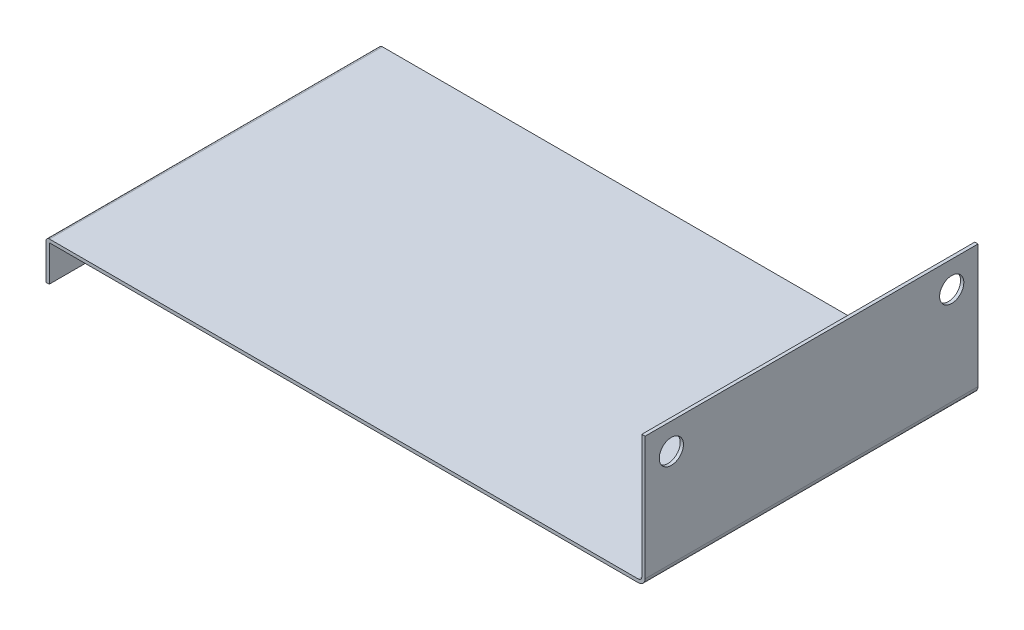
ISO-10303-21;
HEADER;
FILE_DESCRIPTION(('STEP AP214'),'2;1');
FILE_NAME('part.step','',(''),(''),'','','');
FILE_SCHEMA(('AUTOMOTIVE_DESIGN { 1 0 10303 214 1 1 1 1 }'));
ENDSEC;
DATA;
#1=APPLICATION_CONTEXT('core data for automotive mechanical design processes');
#2=APPLICATION_PROTOCOL_DEFINITION('international standard','automotive_design',2000,#1);
#3=PRODUCT_CONTEXT('',#1,'mechanical');
#4=PRODUCT('Part','Part','',(#3));
#5=PRODUCT_RELATED_PRODUCT_CATEGORY('part','',(#4));
#6=PRODUCT_DEFINITION_FORMATION('','',#4);
#7=PRODUCT_DEFINITION_CONTEXT('part definition',#1,'design');
#8=PRODUCT_DEFINITION('design','',#6,#7);
#9=PRODUCT_DEFINITION_SHAPE('','',#8);
#10=(LENGTH_UNIT() NAMED_UNIT(*) SI_UNIT(.MILLI.,.METRE.));
#11=(NAMED_UNIT(*) PLANE_ANGLE_UNIT() SI_UNIT($,.RADIAN.));
#12=(NAMED_UNIT(*) SI_UNIT($,.STERADIAN.) SOLID_ANGLE_UNIT());
#13=UNCERTAINTY_MEASURE_WITH_UNIT(LENGTH_MEASURE(1.E-05),#10,'distance_accuracy_value','');
#14=(GEOMETRIC_REPRESENTATION_CONTEXT(3) GLOBAL_UNCERTAINTY_ASSIGNED_CONTEXT((#13)) GLOBAL_UNIT_ASSIGNED_CONTEXT((#10,
#11,#12)) REPRESENTATION_CONTEXT('',''));
#15=CARTESIAN_POINT('',(0.,0.,0.));
#16=DIRECTION('',(0.,0.,1.));
#17=DIRECTION('',(1.,0.,0.));
#18=AXIS2_PLACEMENT_3D('',#15,#16,#17);
#19=CARTESIAN_POINT('',(218.2622,2.54000000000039,120.65));
#20=DIRECTION('',(-1.,0.,0.));
#21=DIRECTION('',(0.,0.,1.00000000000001));
#22=AXIS2_PLACEMENT_3D('',#19,#20,#21);
#23=PLANE('',#22);
#24=CARTESIAN_POINT('',(218.2622,73.0250000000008,-101.6));
#25=DIRECTION('',(1.,0.,0.));
#26=DIRECTION('',(0.,1.00000000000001,0.));
#27=AXIS2_PLACEMENT_3D('',#24,#25,#26);
#28=CIRCLE('',#27,8.76299999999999);
#29=CARTESIAN_POINT('',(218.2622,81.7880000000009,-101.6));
#30=VERTEX_POINT('',#29);
#31=EDGE_CURVE('E217',#30,#30,#28,.T.);
#32=ORIENTED_EDGE('',*,*,#31,.F.);
#33=EDGE_LOOP('',(#32));
#34=FACE_BOUND('',#33,.T.);
#35=CARTESIAN_POINT('',(218.2622,73.0250000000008,101.6));
#36=DIRECTION('',(1.,0.,0.));
#37=DIRECTION('',(0.,1.00000000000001,0.));
#38=AXIS2_PLACEMENT_3D('',#35,#36,#37);
#39=CIRCLE('',#38,8.76299999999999);
#40=CARTESIAN_POINT('',(218.2622,81.7880000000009,101.6));
#41=VERTEX_POINT('',#40);
#42=EDGE_CURVE('E214',#41,#41,#39,.T.);
#43=ORIENTED_EDGE('',*,*,#42,.F.);
#44=EDGE_LOOP('',(#43));
#45=FACE_BOUND('',#44,.T.);
#46=DIRECTION('',(0.,1.00000000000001,0.));
#47=VECTOR('',#46,1.);
#48=CARTESIAN_POINT('',(218.2622,2.54000000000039,-120.65));
#49=LINE('',#48,#47);
#50=CARTESIAN_POINT('',(218.2622,2.54000000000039,-120.65));
#51=VERTEX_POINT('',#50);
#52=CARTESIAN_POINT('',(218.2622,92.0750000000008,-120.65));
#53=VERTEX_POINT('',#52);
#54=EDGE_CURVE('E126',#51,#53,#49,.T.);
#55=ORIENTED_EDGE('',*,*,#54,.T.);
#56=DIRECTION('',(0.,0.,-1.00000000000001));
#57=VECTOR('',#56,1.);
#58=CARTESIAN_POINT('',(218.2622,92.0750000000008,120.65));
#59=LINE('',#58,#57);
#60=CARTESIAN_POINT('',(218.2622,92.0750000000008,120.65));
#61=VERTEX_POINT('',#60);
#62=EDGE_CURVE('E11',#61,#53,#59,.T.);
#63=ORIENTED_EDGE('',*,*,#62,.F.);
#64=DIRECTION('',(0.,1.00000000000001,0.));
#65=VECTOR('',#64,1.);
#66=CARTESIAN_POINT('',(218.2622,2.54000000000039,120.65));
#67=LINE('',#66,#65);
#68=CARTESIAN_POINT('',(218.2622,2.54000000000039,120.65));
#69=VERTEX_POINT('',#68);
#70=EDGE_CURVE('E162',#69,#61,#67,.T.);
#71=ORIENTED_EDGE('',*,*,#70,.F.);
#72=DIRECTION('',(0.,0.,-1.00000000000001));
#73=VECTOR('',#72,1.);
#74=CARTESIAN_POINT('',(218.2622,2.54000000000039,120.65));
#75=LINE('',#74,#73);
#76=EDGE_CURVE('E127',#69,#51,#75,.T.);
#77=ORIENTED_EDGE('',*,*,#76,.T.);
#78=EDGE_LOOP('',(#55,#63,#71,#77));
#79=FACE_BOUND('',#78,.T.);
#80=ADVANCED_FACE('F26',(#34,#45,#79),#23,.F.);
#81=CARTESIAN_POINT('',(215.9,92.0750000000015,120.65));
#82=DIRECTION('',(0.,1.00000000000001,0.));
#83=DIRECTION('',(0.,0.,1.00000000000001));
#84=AXIS2_PLACEMENT_3D('',#81,#82,#83);
#85=PLANE('',#84);
#86=DIRECTION('',(1.,0.,0.));
#87=VECTOR('',#86,1.);
#88=CARTESIAN_POINT('',(215.9,92.0750000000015,-120.65));
#89=LINE('',#88,#87);
#90=CARTESIAN_POINT('',(215.9,92.0750000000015,-120.65));
#91=VERTEX_POINT('',#90);
#92=EDGE_CURVE('E118',#91,#53,#89,.T.);
#93=ORIENTED_EDGE('',*,*,#92,.F.);
#94=DIRECTION('',(0.,0.,-1.00000000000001));
#95=VECTOR('',#94,1.);
#96=CARTESIAN_POINT('',(215.9,92.0750000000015,120.65));
#97=LINE('',#96,#95);
#98=CARTESIAN_POINT('',(215.9,92.0750000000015,120.65));
#99=VERTEX_POINT('',#98);
#100=EDGE_CURVE('E34',#99,#91,#97,.T.);
#101=ORIENTED_EDGE('',*,*,#100,.F.);
#102=DIRECTION('',(1.,0.,0.));
#103=VECTOR('',#102,1.);
#104=CARTESIAN_POINT('',(215.9,92.0750000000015,120.65));
#105=LINE('',#104,#103);
#106=EDGE_CURVE('E121',#99,#61,#105,.T.);
#107=ORIENTED_EDGE('',*,*,#106,.T.);
#108=ORIENTED_EDGE('',*,*,#62,.T.);
#109=EDGE_LOOP('',(#93,#101,#107,#108));
#110=FACE_BOUND('',#109,.T.);
#111=ADVANCED_FACE('F116',(#110),#85,.T.);
#112=CARTESIAN_POINT('',(215.9,2.54000000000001,120.65));
#113=DIRECTION('',(-1.,0.,0.));
#114=DIRECTION('',(0.,0.,1.00000000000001));
#115=AXIS2_PLACEMENT_3D('',#112,#113,#114);
#116=PLANE('',#115);
#117=CARTESIAN_POINT('',(215.9,73.0250000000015,-101.6));
#118=DIRECTION('',(-1.,0.,0.));
#119=DIRECTION('',(0.,0.,1.00000000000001));
#120=AXIS2_PLACEMENT_3D('',#117,#118,#119);
#121=CIRCLE('',#120,8.76299999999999);
#122=CARTESIAN_POINT('',(215.9,81.7880000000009,-101.6));
#123=VERTEX_POINT('',#122);
#124=EDGE_CURVE('E215',#123,#123,#121,.T.);
#125=ORIENTED_EDGE('',*,*,#124,.F.);
#126=EDGE_LOOP('',(#125));
#127=FACE_BOUND('',#126,.T.);
#128=CARTESIAN_POINT('',(215.9,73.0250000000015,101.6));
#129=DIRECTION('',(-1.,0.,0.));
#130=DIRECTION('',(0.,0.,1.00000000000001));
#131=AXIS2_PLACEMENT_3D('',#128,#129,#130);
#132=CIRCLE('',#131,8.76299999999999);
#133=CARTESIAN_POINT('',(215.9,81.7880000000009,101.6));
#134=VERTEX_POINT('',#133);
#135=EDGE_CURVE('E130',#134,#134,#132,.T.);
#136=ORIENTED_EDGE('',*,*,#135,.F.);
#137=EDGE_LOOP('',(#136));
#138=FACE_BOUND('',#137,.T.);
#139=DIRECTION('',(0.,1.00000000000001,0.));
#140=VECTOR('',#139,1.);
#141=CARTESIAN_POINT('',(215.9,2.54000000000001,-120.65));
#142=LINE('',#141,#140);
#143=CARTESIAN_POINT('',(215.9,2.54000000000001,-120.65));
#144=VERTEX_POINT('',#143);
#145=EDGE_CURVE('E135',#144,#91,#142,.T.);
#146=ORIENTED_EDGE('',*,*,#145,.F.);
#147=DIRECTION('',(0.,0.,-1.00000000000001));
#148=VECTOR('',#147,1.);
#149=CARTESIAN_POINT('',(215.9,2.54000000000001,120.65));
#150=LINE('',#149,#148);
#151=CARTESIAN_POINT('',(215.9,2.54000000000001,120.65));
#152=VERTEX_POINT('',#151);
#153=EDGE_CURVE('E209',#152,#144,#150,.T.);
#154=ORIENTED_EDGE('',*,*,#153,.F.);
#155=DIRECTION('',(0.,1.00000000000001,0.));
#156=VECTOR('',#155,1.);
#157=CARTESIAN_POINT('',(215.9,2.54000000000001,120.65));
#158=LINE('',#157,#156);
#159=EDGE_CURVE('E165',#152,#99,#158,.T.);
#160=ORIENTED_EDGE('',*,*,#159,.T.);
#161=ORIENTED_EDGE('',*,*,#100,.T.);
#162=EDGE_LOOP('',(#146,#154,#160,#161));
#163=FACE_BOUND('',#162,.T.);
#164=ADVANCED_FACE('F242',(#127,#138,#163),#116,.T.);
#165=CARTESIAN_POINT('',(213.36,2.54000000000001,120.65));
#166=DIRECTION('',(0.,0.,-1.00000000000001));
#167=DIRECTION('',(-1.,0.,0.));
#168=AXIS2_PLACEMENT_3D('',#165,#166,#167);
#169=CYLINDRICAL_SURFACE('',#168,2.54000000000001);
#170=CARTESIAN_POINT('',(213.36,2.54000000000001,-120.65));
#171=DIRECTION('',(0.,0.,1.00000000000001));
#172=DIRECTION('',(1.,0.,0.));
#173=AXIS2_PLACEMENT_3D('',#170,#171,#172);
#174=CIRCLE('',#173,2.54000000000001);
#175=CARTESIAN_POINT('',(213.36,0.,-120.65));
#176=VERTEX_POINT('',#175);
#177=EDGE_CURVE('E137',#176,#144,#174,.T.);
#178=ORIENTED_EDGE('',*,*,#177,.F.);
#179=DIRECTION('',(0.,0.,-1.00000000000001));
#180=VECTOR('',#179,1.);
#181=CARTESIAN_POINT('',(213.36,0.,120.65));
#182=LINE('',#181,#180);
#183=CARTESIAN_POINT('',(213.36,0.,120.65));
#184=VERTEX_POINT('',#183);
#185=EDGE_CURVE('E207',#184,#176,#182,.T.);
#186=ORIENTED_EDGE('',*,*,#185,.F.);
#187=CARTESIAN_POINT('',(213.36,2.54000000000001,120.65));
#188=DIRECTION('',(0.,0.,1.00000000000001));
#189=DIRECTION('',(1.,0.,0.));
#190=AXIS2_PLACEMENT_3D('',#187,#188,#189);
#191=CIRCLE('',#190,2.54000000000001);
#192=EDGE_CURVE('E168',#184,#152,#191,.T.);
#193=ORIENTED_EDGE('',*,*,#192,.T.);
#194=ORIENTED_EDGE('',*,*,#153,.T.);
#195=EDGE_LOOP('',(#178,#186,#193,#194));
#196=FACE_BOUND('',#195,.T.);
#197=ADVANCED_FACE('F297',(#196),#169,.F.);
#198=CARTESIAN_POINT('',(-213.36,3.60822483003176E-13,120.65));
#199=DIRECTION('',(0.,1.00000000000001,0.));
#200=DIRECTION('',(0.,0.,1.00000000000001));
#201=AXIS2_PLACEMENT_3D('',#198,#199,#200);
#202=PLANE('',#201);
#203=DIRECTION('',(1.,0.,0.));
#204=VECTOR('',#203,1.);
#205=CARTESIAN_POINT('',(-213.36,3.60822483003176E-13,-120.65));
#206=LINE('',#205,#204);
#207=CARTESIAN_POINT('',(-213.36,3.53883589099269E-13,-120.65));
#208=VERTEX_POINT('',#207);
#209=EDGE_CURVE('E142',#208,#176,#206,.T.);
#210=ORIENTED_EDGE('',*,*,#209,.F.);
#211=DIRECTION('',(0.,0.,-1.00000000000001));
#212=VECTOR('',#211,1.);
#213=CARTESIAN_POINT('',(-213.36,3.53883589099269E-13,120.65));
#214=LINE('',#213,#212);
#215=CARTESIAN_POINT('',(-213.36,3.53883589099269E-13,120.65));
#216=VERTEX_POINT('',#215);
#217=EDGE_CURVE('E205',#216,#208,#214,.T.);
#218=ORIENTED_EDGE('',*,*,#217,.F.);
#219=DIRECTION('',(1.,0.,0.));
#220=VECTOR('',#219,1.);
#221=CARTESIAN_POINT('',(-213.36,3.60822483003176E-13,120.65));
#222=LINE('',#221,#220);
#223=EDGE_CURVE('E171',#216,#184,#222,.T.);
#224=ORIENTED_EDGE('',*,*,#223,.T.);
#225=ORIENTED_EDGE('',*,*,#185,.T.);
#226=EDGE_LOOP('',(#210,#218,#224,#225));
#227=FACE_BOUND('',#226,.T.);
#228=ADVANCED_FACE('F293',(#227),#202,.T.);
#229=CARTESIAN_POINT('',(-213.36,-2.53999999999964,120.65));
#230=DIRECTION('',(0.,0.,-1.00000000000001));
#231=DIRECTION('',(-1.,0.,0.));
#232=AXIS2_PLACEMENT_3D('',#229,#230,#231);
#233=CYLINDRICAL_SURFACE('',#232,2.53999999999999);
#234=CARTESIAN_POINT('',(-213.36,-2.53999999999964,-120.65));
#235=DIRECTION('',(0.,0.,-1.00000000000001));
#236=DIRECTION('',(-1.,0.,0.));
#237=AXIS2_PLACEMENT_3D('',#234,#235,#236);
#238=CIRCLE('',#237,2.53999999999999);
#239=CARTESIAN_POINT('',(-215.9,-2.54000000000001,-120.65));
#240=VERTEX_POINT('',#239);
#241=EDGE_CURVE('E145',#240,#208,#238,.T.);
#242=ORIENTED_EDGE('',*,*,#241,.F.);
#243=DIRECTION('',(0.,0.,-1.00000000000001));
#244=VECTOR('',#243,1.);
#245=CARTESIAN_POINT('',(-215.9,-2.54000000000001,120.65));
#246=LINE('',#245,#244);
#247=CARTESIAN_POINT('',(-215.9,-2.54000000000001,120.65));
#248=VERTEX_POINT('',#247);
#249=EDGE_CURVE('E203',#248,#240,#246,.T.);
#250=ORIENTED_EDGE('',*,*,#249,.F.);
#251=CARTESIAN_POINT('',(-213.36,-2.53999999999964,120.65));
#252=DIRECTION('',(0.,0.,-1.00000000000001));
#253=DIRECTION('',(-1.,0.,0.));
#254=AXIS2_PLACEMENT_3D('',#251,#252,#253);
#255=CIRCLE('',#254,2.53999999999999);
#256=EDGE_CURVE('E174',#248,#216,#255,.T.);
#257=ORIENTED_EDGE('',*,*,#256,.T.);
#258=ORIENTED_EDGE('',*,*,#217,.T.);
#259=EDGE_LOOP('',(#242,#250,#257,#258));
#260=FACE_BOUND('',#259,.T.);
#261=ADVANCED_FACE('F289',(#260),#233,.T.);
#262=CARTESIAN_POINT('',(-215.9,-28.448,120.65));
#263=DIRECTION('',(-1.,0.,0.));
#264=DIRECTION('',(0.,0.,1.00000000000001));
#265=AXIS2_PLACEMENT_3D('',#262,#263,#264);
#266=PLANE('',#265);
#267=CARTESIAN_POINT('',(-215.9,-15.7479999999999,-88.9));
#268=DIRECTION('',(1.,0.,0.));
#269=DIRECTION('',(0.,1.00000000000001,0.));
#270=AXIS2_PLACEMENT_3D('',#267,#268,#269);
#271=CIRCLE('',#270,5.20700000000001);
#272=CARTESIAN_POINT('',(-215.9,-10.5409999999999,-88.9));
#273=VERTEX_POINT('',#272);
#274=EDGE_CURVE('E230',#273,#273,#271,.T.);
#275=ORIENTED_EDGE('',*,*,#274,.T.);
#276=EDGE_LOOP('',(#275));
#277=FACE_BOUND('',#276,.T.);
#278=CARTESIAN_POINT('',(-215.9,-15.7479999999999,88.9));
#279=DIRECTION('',(1.,0.,0.));
#280=DIRECTION('',(0.,1.00000000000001,0.));
#281=AXIS2_PLACEMENT_3D('',#278,#279,#280);
#282=CIRCLE('',#281,5.20700000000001);
#283=CARTESIAN_POINT('',(-215.9,-10.5409999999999,88.9));
#284=VERTEX_POINT('',#283);
#285=EDGE_CURVE('E220',#284,#284,#282,.T.);
#286=ORIENTED_EDGE('',*,*,#285,.T.);
#287=EDGE_LOOP('',(#286));
#288=FACE_BOUND('',#287,.T.);
#289=DIRECTION('',(0.,1.00000000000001,0.));
#290=VECTOR('',#289,1.);
#291=CARTESIAN_POINT('',(-215.9,-28.448,-120.65));
#292=LINE('',#291,#290);
#293=CARTESIAN_POINT('',(-215.9,-28.448,-120.65));
#294=VERTEX_POINT('',#293);
#295=EDGE_CURVE('E148',#294,#240,#292,.T.);
#296=ORIENTED_EDGE('',*,*,#295,.F.);
#297=DIRECTION('',(0.,0.,-1.00000000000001));
#298=VECTOR('',#297,1.);
#299=CARTESIAN_POINT('',(-215.9,-28.448,120.65));
#300=LINE('',#299,#298);
#301=CARTESIAN_POINT('',(-215.9,-28.448,120.65));
#302=VERTEX_POINT('',#301);
#303=EDGE_CURVE('E201',#302,#294,#300,.T.);
#304=ORIENTED_EDGE('',*,*,#303,.F.);
#305=DIRECTION('',(0.,1.00000000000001,0.));
#306=VECTOR('',#305,1.);
#307=CARTESIAN_POINT('',(-215.9,-28.448,120.65));
#308=LINE('',#307,#306);
#309=EDGE_CURVE('E177',#302,#248,#308,.T.);
#310=ORIENTED_EDGE('',*,*,#309,.T.);
#311=ORIENTED_EDGE('',*,*,#249,.T.);
#312=EDGE_LOOP('',(#296,#304,#310,#311));
#313=FACE_BOUND('',#312,.T.);
#314=ADVANCED_FACE('F285',(#277,#288,#313),#266,.T.);
#315=CARTESIAN_POINT('',(-213.5378,-28.448,120.65));
#316=DIRECTION('',(0.,-1.00000000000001,0.));
#317=DIRECTION('',(0.,0.,-1.00000000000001));
#318=AXIS2_PLACEMENT_3D('',#315,#316,#317);
#319=PLANE('',#318);
#320=DIRECTION('',(-1.,0.,0.));
#321=VECTOR('',#320,1.);
#322=CARTESIAN_POINT('',(-213.5378,-28.448,-120.65));
#323=LINE('',#322,#321);
#324=CARTESIAN_POINT('',(-213.5378,-28.448,-120.65));
#325=VERTEX_POINT('',#324);
#326=EDGE_CURVE('E151',#325,#294,#323,.T.);
#327=ORIENTED_EDGE('',*,*,#326,.F.);
#328=DIRECTION('',(0.,0.,-1.00000000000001));
#329=VECTOR('',#328,1.);
#330=CARTESIAN_POINT('',(-213.5378,-28.448,120.65));
#331=LINE('',#330,#329);
#332=CARTESIAN_POINT('',(-213.5378,-28.448,120.65));
#333=VERTEX_POINT('',#332);
#334=EDGE_CURVE('E199',#333,#325,#331,.T.);
#335=ORIENTED_EDGE('',*,*,#334,.F.);
#336=DIRECTION('',(-1.,0.,0.));
#337=VECTOR('',#336,1.);
#338=CARTESIAN_POINT('',(-213.5378,-28.448,120.65));
#339=LINE('',#338,#337);
#340=EDGE_CURVE('E180',#333,#302,#339,.T.);
#341=ORIENTED_EDGE('',*,*,#340,.T.);
#342=ORIENTED_EDGE('',*,*,#303,.T.);
#343=EDGE_LOOP('',(#327,#335,#341,#342));
#344=FACE_BOUND('',#343,.T.);
#345=ADVANCED_FACE('F281',(#344),#319,.T.);
#346=CARTESIAN_POINT('',(-213.5378,-28.448,120.65));
#347=DIRECTION('',(-1.,0.,0.));
#348=DIRECTION('',(0.,0.,1.00000000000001));
#349=AXIS2_PLACEMENT_3D('',#346,#347,#348);
#350=PLANE('',#349);
#351=CARTESIAN_POINT('',(-213.5378,-15.7479999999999,-88.9));
#352=DIRECTION('',(-1.,0.,0.));
#353=DIRECTION('',(0.,0.,1.00000000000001));
#354=AXIS2_PLACEMENT_3D('',#351,#352,#353);
#355=CIRCLE('',#354,5.20700000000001);
#356=CARTESIAN_POINT('',(-213.5378,-10.5409999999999,-88.9));
#357=VERTEX_POINT('',#356);
#358=EDGE_CURVE('E29',#357,#357,#355,.T.);
#359=ORIENTED_EDGE('',*,*,#358,.T.);
#360=EDGE_LOOP('',(#359));
#361=FACE_BOUND('',#360,.T.);
#362=CARTESIAN_POINT('',(-213.5378,-15.7479999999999,88.9));
#363=DIRECTION('',(-1.,0.,0.));
#364=DIRECTION('',(0.,0.,1.00000000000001));
#365=AXIS2_PLACEMENT_3D('',#362,#363,#364);
#366=CIRCLE('',#365,5.20700000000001);
#367=CARTESIAN_POINT('',(-213.5378,-10.5409999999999,88.9));
#368=VERTEX_POINT('',#367);
#369=EDGE_CURVE('E218',#368,#368,#366,.T.);
#370=ORIENTED_EDGE('',*,*,#369,.T.);
#371=EDGE_LOOP('',(#370));
#372=FACE_BOUND('',#371,.T.);
#373=DIRECTION('',(0.,1.00000000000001,0.));
#374=VECTOR('',#373,1.);
#375=CARTESIAN_POINT('',(-213.5378,-28.448,-120.65));
#376=LINE('',#375,#374);
#377=CARTESIAN_POINT('',(-213.5378,-2.54000000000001,-120.65));
#378=VERTEX_POINT('',#377);
#379=EDGE_CURVE('E154',#325,#378,#376,.T.);
#380=ORIENTED_EDGE('',*,*,#379,.T.);
#381=DIRECTION('',(0.,0.,-1.00000000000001));
#382=VECTOR('',#381,1.);
#383=CARTESIAN_POINT('',(-213.5378,-2.54000000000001,120.65));
#384=LINE('',#383,#382);
#385=CARTESIAN_POINT('',(-213.5378,-2.54000000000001,120.65));
#386=VERTEX_POINT('',#385);
#387=EDGE_CURVE('E196',#386,#378,#384,.T.);
#388=ORIENTED_EDGE('',*,*,#387,.F.);
#389=DIRECTION('',(0.,1.00000000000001,0.));
#390=VECTOR('',#389,1.);
#391=CARTESIAN_POINT('',(-213.5378,-28.448,120.65));
#392=LINE('',#391,#390);
#393=EDGE_CURVE('E183',#333,#386,#392,.T.);
#394=ORIENTED_EDGE('',*,*,#393,.F.);
#395=ORIENTED_EDGE('',*,*,#334,.T.);
#396=EDGE_LOOP('',(#380,#388,#394,#395));
#397=FACE_BOUND('',#396,.T.);
#398=ADVANCED_FACE('F277',(#361,#372,#397),#350,.F.);
#399=CARTESIAN_POINT('',(-213.36,-2.53999999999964,120.65));
#400=DIRECTION('',(0.,0.,-1.00000000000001));
#401=DIRECTION('',(-1.,0.,0.));
#402=AXIS2_PLACEMENT_3D('',#399,#400,#401);
#403=CYLINDRICAL_SURFACE('',#402,0.177799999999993);
#404=CARTESIAN_POINT('',(-213.36,-2.53999999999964,-120.65));
#405=DIRECTION('',(0.,0.,1.00000000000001));
#406=DIRECTION('',(1.,0.,0.));
#407=AXIS2_PLACEMENT_3D('',#404,#405,#406);
#408=CIRCLE('',#407,0.177799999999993);
#409=CARTESIAN_POINT('',(-213.36,-2.36219999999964,-120.65));
#410=VERTEX_POINT('',#409);
#411=EDGE_CURVE('E156',#378,#410,#408,.F.);
#412=ORIENTED_EDGE('',*,*,#411,.T.);
#413=DIRECTION('',(0.,0.,-1.00000000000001));
#414=VECTOR('',#413,1.);
#415=CARTESIAN_POINT('',(-213.36,-2.36219999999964,120.65));
#416=LINE('',#415,#414);
#417=CARTESIAN_POINT('',(-213.36,-2.36219999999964,120.65));
#418=VERTEX_POINT('',#417);
#419=EDGE_CURVE('E193',#418,#410,#416,.T.);
#420=ORIENTED_EDGE('',*,*,#419,.F.);
#421=CARTESIAN_POINT('',(-213.36,-2.53999999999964,120.65));
#422=DIRECTION('',(0.,0.,1.00000000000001));
#423=DIRECTION('',(1.,0.,0.));
#424=AXIS2_PLACEMENT_3D('',#421,#422,#423);
#425=CIRCLE('',#424,0.177799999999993);
#426=EDGE_CURVE('E185',#386,#418,#425,.F.);
#427=ORIENTED_EDGE('',*,*,#426,.F.);
#428=ORIENTED_EDGE('',*,*,#387,.T.);
#429=EDGE_LOOP('',(#412,#420,#427,#428));
#430=FACE_BOUND('',#429,.T.);
#431=ADVANCED_FACE('F273',(#430),#403,.F.);
#432=CARTESIAN_POINT('',(-213.36,-2.36219999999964,120.65));
#433=DIRECTION('',(0.,1.00000000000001,0.));
#434=DIRECTION('',(0.,0.,1.00000000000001));
#435=AXIS2_PLACEMENT_3D('',#432,#433,#434);
#436=PLANE('',#435);
#437=DIRECTION('',(1.,0.,0.));
#438=VECTOR('',#437,1.);
#439=CARTESIAN_POINT('',(-213.36,-2.36219999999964,-120.65));
#440=LINE('',#439,#438);
#441=CARTESIAN_POINT('',(213.36,-2.36219999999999,-120.65));
#442=VERTEX_POINT('',#441);
#443=EDGE_CURVE('E158',#410,#442,#440,.T.);
#444=ORIENTED_EDGE('',*,*,#443,.T.);
#445=DIRECTION('',(0.,0.,-1.00000000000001));
#446=VECTOR('',#445,1.);
#447=CARTESIAN_POINT('',(213.36,-2.36219999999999,120.65));
#448=LINE('',#447,#446);
#449=CARTESIAN_POINT('',(213.36,-2.36219999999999,120.65));
#450=VERTEX_POINT('',#449);
#451=EDGE_CURVE('E190',#450,#442,#448,.T.);
#452=ORIENTED_EDGE('',*,*,#451,.F.);
#453=DIRECTION('',(1.,0.,0.));
#454=VECTOR('',#453,1.);
#455=CARTESIAN_POINT('',(-213.36,-2.36219999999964,120.65));
#456=LINE('',#455,#454);
#457=EDGE_CURVE('E47',#418,#450,#456,.T.);
#458=ORIENTED_EDGE('',*,*,#457,.F.);
#459=ORIENTED_EDGE('',*,*,#419,.T.);
#460=EDGE_LOOP('',(#444,#452,#458,#459));
#461=FACE_BOUND('',#460,.T.);
#462=ADVANCED_FACE('F269',(#461),#436,.F.);
#463=CARTESIAN_POINT('',(213.36,2.54000000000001,120.65));
#464=DIRECTION('',(0.,0.,-1.00000000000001));
#465=DIRECTION('',(-1.,0.,0.));
#466=AXIS2_PLACEMENT_3D('',#463,#464,#465);
#467=CYLINDRICAL_SURFACE('',#466,4.90220000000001);
#468=CARTESIAN_POINT('',(213.36,2.54000000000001,-120.65));
#469=DIRECTION('',(0.,0.,1.00000000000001));
#470=DIRECTION('',(1.,0.,0.));
#471=AXIS2_PLACEMENT_3D('',#468,#469,#470);
#472=CIRCLE('',#471,4.90220000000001);
#473=EDGE_CURVE('E160',#442,#51,#472,.T.);
#474=ORIENTED_EDGE('',*,*,#473,.T.);
#475=ORIENTED_EDGE('',*,*,#76,.F.);
#476=CARTESIAN_POINT('',(213.36,2.54000000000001,120.65));
#477=DIRECTION('',(0.,0.,1.00000000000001));
#478=DIRECTION('',(1.,0.,0.));
#479=AXIS2_PLACEMENT_3D('',#476,#477,#478);
#480=CIRCLE('',#479,4.90220000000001);
#481=EDGE_CURVE('E42',#450,#69,#480,.T.);
#482=ORIENTED_EDGE('',*,*,#481,.F.);
#483=ORIENTED_EDGE('',*,*,#451,.T.);
#484=EDGE_LOOP('',(#474,#475,#482,#483));
#485=FACE_BOUND('',#484,.T.);
#486=ADVANCED_FACE('F266',(#485),#467,.T.);
#487=CARTESIAN_POINT('',(213.36,2.54000000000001,120.65));
#488=DIRECTION('',(0.,0.,1.00000000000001));
#489=DIRECTION('',(1.,0.,0.));
#490=AXIS2_PLACEMENT_3D('',#487,#488,#489);
#491=PLANE('',#490);
#492=ORIENTED_EDGE('',*,*,#70,.T.);
#493=ORIENTED_EDGE('',*,*,#106,.F.);
#494=ORIENTED_EDGE('',*,*,#159,.F.);
#495=ORIENTED_EDGE('',*,*,#192,.F.);
#496=ORIENTED_EDGE('',*,*,#223,.F.);
#497=ORIENTED_EDGE('',*,*,#256,.F.);
#498=ORIENTED_EDGE('',*,*,#309,.F.);
#499=ORIENTED_EDGE('',*,*,#340,.F.);
#500=ORIENTED_EDGE('',*,*,#393,.T.);
#501=ORIENTED_EDGE('',*,*,#426,.T.);
#502=ORIENTED_EDGE('',*,*,#457,.T.);
#503=ORIENTED_EDGE('',*,*,#481,.T.);
#504=EDGE_LOOP('',(#492,#493,#494,#495,#496,#497,#498,#499,#500,#501,#502,#503));
#505=FACE_BOUND('',#504,.T.);
#506=ADVANCED_FACE('F263',(#505),#491,.T.);
#507=CARTESIAN_POINT('',(213.36,2.54000000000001,-120.65));
#508=DIRECTION('',(0.,0.,1.00000000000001));
#509=DIRECTION('',(1.,0.,0.));
#510=AXIS2_PLACEMENT_3D('',#507,#508,#509);
#511=PLANE('',#510);
#512=ORIENTED_EDGE('',*,*,#54,.F.);
#513=ORIENTED_EDGE('',*,*,#473,.F.);
#514=ORIENTED_EDGE('',*,*,#443,.F.);
#515=ORIENTED_EDGE('',*,*,#411,.F.);
#516=ORIENTED_EDGE('',*,*,#379,.F.);
#517=ORIENTED_EDGE('',*,*,#326,.T.);
#518=ORIENTED_EDGE('',*,*,#295,.T.);
#519=ORIENTED_EDGE('',*,*,#241,.T.);
#520=ORIENTED_EDGE('',*,*,#209,.T.);
#521=ORIENTED_EDGE('',*,*,#177,.T.);
#522=ORIENTED_EDGE('',*,*,#145,.T.);
#523=ORIENTED_EDGE('',*,*,#92,.T.);
#524=EDGE_LOOP('',(#512,#513,#514,#515,#516,#517,#518,#519,#520,#521,#522,#523));
#525=FACE_BOUND('',#524,.T.);
#526=ADVANCED_FACE('F132',(#525),#511,.F.);
#527=CARTESIAN_POINT('',(-215.9,73.0250000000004,101.6));
#528=DIRECTION('',(1.,0.,0.));
#529=DIRECTION('',(0.,1.00000000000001,0.));
#530=AXIS2_PLACEMENT_3D('',#527,#528,#529);
#531=CYLINDRICAL_SURFACE('',#530,8.76299999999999);
#532=CARTESIAN_POINT('',(215.9,81.7880000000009,101.6));
#533=CARTESIAN_POINT('',(215.92460625,81.7880000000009,101.6));
#534=CARTESIAN_POINT('',(215.9492125,81.7880000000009,101.6));
#535=CARTESIAN_POINT('',(215.998425,81.7880000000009,101.6));
#536=CARTESIAN_POINT('',(216.02303125,81.7880000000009,101.6));
#537=CARTESIAN_POINT('',(216.07224375,81.7880000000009,101.6));
#538=CARTESIAN_POINT('',(216.09685,81.7880000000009,101.6));
#539=CARTESIAN_POINT('',(216.1460625,81.7880000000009,101.6));
#540=CARTESIAN_POINT('',(216.17066875,81.7880000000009,101.6));
#541=CARTESIAN_POINT('',(216.21988125,81.7880000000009,101.6));
#542=CARTESIAN_POINT('',(216.2444875,81.7880000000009,101.6));
#543=CARTESIAN_POINT('',(216.2937,81.7880000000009,101.6));
#544=CARTESIAN_POINT('',(216.31830625,81.7880000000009,101.6));
#545=CARTESIAN_POINT('',(216.36751875,81.7880000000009,101.6));
#546=CARTESIAN_POINT('',(216.392125,81.7880000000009,101.6));
#547=CARTESIAN_POINT('',(216.4413375,81.7880000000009,101.6));
#548=CARTESIAN_POINT('',(216.46594375,81.7880000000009,101.6));
#549=CARTESIAN_POINT('',(216.51515625,81.7880000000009,101.6));
#550=CARTESIAN_POINT('',(216.5397625,81.7880000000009,101.6));
#551=CARTESIAN_POINT('',(216.588975,81.7880000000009,101.6));
#552=CARTESIAN_POINT('',(216.61358125,81.7880000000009,101.6));
#553=CARTESIAN_POINT('',(216.66279375,81.7880000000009,101.6));
#554=CARTESIAN_POINT('',(216.6874,81.7880000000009,101.6));
#555=CARTESIAN_POINT('',(216.7366125,81.7880000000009,101.6));
#556=CARTESIAN_POINT('',(216.76121875,81.7880000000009,101.6));
#557=CARTESIAN_POINT('',(216.81043125,81.7880000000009,101.6));
#558=CARTESIAN_POINT('',(216.8350375,81.7880000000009,101.6));
#559=CARTESIAN_POINT('',(216.88425,81.7880000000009,101.6));
#560=CARTESIAN_POINT('',(216.90885625,81.7880000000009,101.6));
#561=CARTESIAN_POINT('',(216.95806875,81.7880000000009,101.6));
#562=CARTESIAN_POINT('',(216.982675,81.7880000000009,101.6));
#563=CARTESIAN_POINT('',(217.0318875,81.7880000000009,101.6));
#564=CARTESIAN_POINT('',(217.05649375,81.7880000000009,101.6));
#565=CARTESIAN_POINT('',(217.10570625,81.7880000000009,101.6));
#566=CARTESIAN_POINT('',(217.1303125,81.7880000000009,101.6));
#567=CARTESIAN_POINT('',(217.179525,81.7880000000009,101.6));
#568=CARTESIAN_POINT('',(217.20413125,81.7880000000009,101.6));
#569=CARTESIAN_POINT('',(217.25334375,81.7880000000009,101.6));
#570=CARTESIAN_POINT('',(217.27795,81.7880000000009,101.6));
#571=CARTESIAN_POINT('',(217.3271625,81.7880000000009,101.6));
#572=CARTESIAN_POINT('',(217.35176875,81.7880000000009,101.6));
#573=CARTESIAN_POINT('',(217.40098125,81.7880000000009,101.6));
#574=CARTESIAN_POINT('',(217.4255875,81.7880000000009,101.6));
#575=CARTESIAN_POINT('',(217.4748,81.7880000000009,101.6));
#576=CARTESIAN_POINT('',(217.49940625,81.7880000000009,101.6));
#577=CARTESIAN_POINT('',(217.54861875,81.7880000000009,101.6));
#578=CARTESIAN_POINT('',(217.573225,81.7880000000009,101.6));
#579=CARTESIAN_POINT('',(217.6224375,81.7880000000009,101.6));
#580=CARTESIAN_POINT('',(217.64704375,81.7880000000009,101.6));
#581=CARTESIAN_POINT('',(217.69625625,81.7880000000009,101.6));
#582=CARTESIAN_POINT('',(217.7208625,81.7880000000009,101.6));
#583=CARTESIAN_POINT('',(217.770075,81.7880000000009,101.6));
#584=CARTESIAN_POINT('',(217.79468125,81.7880000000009,101.6));
#585=CARTESIAN_POINT('',(217.84389375,81.7880000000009,101.6));
#586=CARTESIAN_POINT('',(217.8685,81.7880000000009,101.6));
#587=CARTESIAN_POINT('',(217.9177125,81.7880000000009,101.6));
#588=CARTESIAN_POINT('',(217.94231875,81.7880000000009,101.6));
#589=CARTESIAN_POINT('',(217.99153125,81.7880000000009,101.6));
#590=CARTESIAN_POINT('',(218.0161375,81.7880000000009,101.6));
#591=CARTESIAN_POINT('',(218.06535,81.7880000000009,101.6));
#592=CARTESIAN_POINT('',(218.08995625,81.7880000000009,101.6));
#593=CARTESIAN_POINT('',(218.13916875,81.7880000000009,101.6));
#594=CARTESIAN_POINT('',(218.163775,81.7880000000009,101.6));
#595=CARTESIAN_POINT('',(218.2129875,81.7880000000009,101.6));
#596=CARTESIAN_POINT('',(218.23759375,81.7880000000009,101.6));
#597=CARTESIAN_POINT('',(218.2622,81.7880000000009,101.6));
#598=B_SPLINE_CURVE_WITH_KNOTS('',3,(#532,#533,#534,#535,#536,#537,#538,#539,#540,#541,#542,
#543,#544,#545,#546,#547,#548,#549,#550,#551,#552,#553,#554,#555,#556,#557,#558,#559,#560,#561,
#562,#563,#564,#565,#566,#567,#568,#569,#570,#571,#572,#573,#574,#575,#576,#577,#578,#579,#580,
#581,#582,#583,#584,#585,#586,#587,#588,#589,#590,#591,#592,#593,#594,#595,#596,#597),
.UNSPECIFIED.,.F.,.F.,(4,2,2,2,2,2,2,2,2,2,2,2,2,2,2,2,2,2,2,2,2,2,2,2,2,2,2,2,2,2,2,2,4),(0.,
0.0738187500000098,0.14763750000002,0.221456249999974,0.295274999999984,0.369093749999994,
0.442912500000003,0.516731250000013,0.590549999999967,0.664368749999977,0.738187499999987,
0.812006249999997,0.885825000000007,0.959643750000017,1.03346249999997,1.10728124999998,
1.18109999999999,1.25491875,1.32873750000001,1.40255624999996,1.47637499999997,1.55019374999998,
1.62401249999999,1.69783125,1.77165000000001,1.84546874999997,1.91928749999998,1.99310624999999,
2.066925,2.14074375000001,2.21456249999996,2.28838124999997,2.36219999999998),.UNSPECIFIED.);
#599=EDGE_CURVE('BSEAM235',#134,#41,#598,.T.);
#600=ORIENTED_EDGE('',*,*,#135,.T.);
#601=ORIENTED_EDGE('',*,*,#42,.T.);
#602=ORIENTED_EDGE('',*,*,#599,.T.);
#603=ORIENTED_EDGE('',*,*,#599,.F.);
#604=EDGE_LOOP('',(#600,#602,#601,#603));
#605=FACE_BOUND('',#604,.T.);
#606=ADVANCED_FACE('F235',(#605),#531,.F.);
#607=CARTESIAN_POINT('',(-215.9,73.0250000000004,-101.6));
#608=DIRECTION('',(1.,0.,0.));
#609=DIRECTION('',(0.,1.00000000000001,0.));
#610=AXIS2_PLACEMENT_3D('',#607,#608,#609);
#611=CYLINDRICAL_SURFACE('',#610,8.76299999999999);
#612=CARTESIAN_POINT('',(215.9,81.7880000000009,-101.6));
#613=CARTESIAN_POINT('',(215.92460625,81.7880000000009,-101.6));
#614=CARTESIAN_POINT('',(215.9492125,81.7880000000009,-101.6));
#615=CARTESIAN_POINT('',(215.998425,81.7880000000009,-101.6));
#616=CARTESIAN_POINT('',(216.02303125,81.7880000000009,-101.6));
#617=CARTESIAN_POINT('',(216.07224375,81.7880000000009,-101.6));
#618=CARTESIAN_POINT('',(216.09685,81.7880000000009,-101.6));
#619=CARTESIAN_POINT('',(216.1460625,81.7880000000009,-101.6));
#620=CARTESIAN_POINT('',(216.17066875,81.7880000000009,-101.6));
#621=CARTESIAN_POINT('',(216.21988125,81.7880000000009,-101.6));
#622=CARTESIAN_POINT('',(216.2444875,81.7880000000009,-101.6));
#623=CARTESIAN_POINT('',(216.2937,81.7880000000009,-101.6));
#624=CARTESIAN_POINT('',(216.31830625,81.7880000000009,-101.6));
#625=CARTESIAN_POINT('',(216.36751875,81.7880000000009,-101.6));
#626=CARTESIAN_POINT('',(216.392125,81.7880000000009,-101.6));
#627=CARTESIAN_POINT('',(216.4413375,81.7880000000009,-101.6));
#628=CARTESIAN_POINT('',(216.46594375,81.7880000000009,-101.6));
#629=CARTESIAN_POINT('',(216.51515625,81.7880000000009,-101.6));
#630=CARTESIAN_POINT('',(216.5397625,81.7880000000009,-101.6));
#631=CARTESIAN_POINT('',(216.588975,81.7880000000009,-101.6));
#632=CARTESIAN_POINT('',(216.61358125,81.7880000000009,-101.6));
#633=CARTESIAN_POINT('',(216.66279375,81.7880000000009,-101.6));
#634=CARTESIAN_POINT('',(216.6874,81.7880000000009,-101.6));
#635=CARTESIAN_POINT('',(216.7366125,81.7880000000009,-101.6));
#636=CARTESIAN_POINT('',(216.76121875,81.7880000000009,-101.6));
#637=CARTESIAN_POINT('',(216.81043125,81.7880000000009,-101.6));
#638=CARTESIAN_POINT('',(216.8350375,81.7880000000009,-101.6));
#639=CARTESIAN_POINT('',(216.88425,81.7880000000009,-101.6));
#640=CARTESIAN_POINT('',(216.90885625,81.7880000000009,-101.6));
#641=CARTESIAN_POINT('',(216.95806875,81.7880000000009,-101.6));
#642=CARTESIAN_POINT('',(216.982675,81.7880000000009,-101.6));
#643=CARTESIAN_POINT('',(217.0318875,81.7880000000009,-101.6));
#644=CARTESIAN_POINT('',(217.05649375,81.7880000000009,-101.6));
#645=CARTESIAN_POINT('',(217.10570625,81.7880000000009,-101.6));
#646=CARTESIAN_POINT('',(217.1303125,81.7880000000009,-101.6));
#647=CARTESIAN_POINT('',(217.179525,81.7880000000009,-101.6));
#648=CARTESIAN_POINT('',(217.20413125,81.7880000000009,-101.6));
#649=CARTESIAN_POINT('',(217.25334375,81.7880000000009,-101.6));
#650=CARTESIAN_POINT('',(217.27795,81.7880000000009,-101.6));
#651=CARTESIAN_POINT('',(217.3271625,81.7880000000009,-101.6));
#652=CARTESIAN_POINT('',(217.35176875,81.7880000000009,-101.6));
#653=CARTESIAN_POINT('',(217.40098125,81.7880000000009,-101.6));
#654=CARTESIAN_POINT('',(217.4255875,81.7880000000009,-101.6));
#655=CARTESIAN_POINT('',(217.4748,81.7880000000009,-101.6));
#656=CARTESIAN_POINT('',(217.49940625,81.7880000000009,-101.6));
#657=CARTESIAN_POINT('',(217.54861875,81.7880000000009,-101.6));
#658=CARTESIAN_POINT('',(217.573225,81.7880000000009,-101.6));
#659=CARTESIAN_POINT('',(217.6224375,81.7880000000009,-101.6));
#660=CARTESIAN_POINT('',(217.64704375,81.7880000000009,-101.6));
#661=CARTESIAN_POINT('',(217.69625625,81.7880000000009,-101.6));
#662=CARTESIAN_POINT('',(217.7208625,81.7880000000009,-101.6));
#663=CARTESIAN_POINT('',(217.770075,81.7880000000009,-101.6));
#664=CARTESIAN_POINT('',(217.79468125,81.7880000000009,-101.6));
#665=CARTESIAN_POINT('',(217.84389375,81.7880000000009,-101.6));
#666=CARTESIAN_POINT('',(217.8685,81.7880000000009,-101.6));
#667=CARTESIAN_POINT('',(217.9177125,81.7880000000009,-101.6));
#668=CARTESIAN_POINT('',(217.94231875,81.7880000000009,-101.6));
#669=CARTESIAN_POINT('',(217.99153125,81.7880000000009,-101.6));
#670=CARTESIAN_POINT('',(218.0161375,81.7880000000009,-101.6));
#671=CARTESIAN_POINT('',(218.06535,81.7880000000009,-101.6));
#672=CARTESIAN_POINT('',(218.08995625,81.7880000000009,-101.6));
#673=CARTESIAN_POINT('',(218.13916875,81.7880000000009,-101.6));
#674=CARTESIAN_POINT('',(218.163775,81.7880000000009,-101.6));
#675=CARTESIAN_POINT('',(218.2129875,81.7880000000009,-101.6));
#676=CARTESIAN_POINT('',(218.23759375,81.7880000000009,-101.6));
#677=CARTESIAN_POINT('',(218.2622,81.7880000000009,-101.6));
#678=B_SPLINE_CURVE_WITH_KNOTS('',3,(#612,#613,#614,#615,#616,#617,#618,#619,#620,#621,#622,
#623,#624,#625,#626,#627,#628,#629,#630,#631,#632,#633,#634,#635,#636,#637,#638,#639,#640,#641,
#642,#643,#644,#645,#646,#647,#648,#649,#650,#651,#652,#653,#654,#655,#656,#657,#658,#659,#660,
#661,#662,#663,#664,#665,#666,#667,#668,#669,#670,#671,#672,#673,#674,#675,#676,#677),
.UNSPECIFIED.,.F.,.F.,(4,2,2,2,2,2,2,2,2,2,2,2,2,2,2,2,2,2,2,2,2,2,2,2,2,2,2,2,2,2,2,2,4),(0.,
0.0738187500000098,0.147637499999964,0.221456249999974,0.295274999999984,0.369093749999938,
0.442912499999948,0.516731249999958,0.590549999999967,0.664368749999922,0.738187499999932,
0.812006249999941,0.885824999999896,0.959643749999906,1.03346249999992,1.10728124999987,
1.18109999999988,1.25491874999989,1.32873749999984,1.40255624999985,1.47637499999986,
1.55019374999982,1.62401249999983,1.69783124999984,1.77164999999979,1.8454687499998,
1.91928749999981,1.99310624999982,2.06692499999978,2.14074374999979,2.21456249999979,
2.28838124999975,2.36219999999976),.UNSPECIFIED.);
#679=EDGE_CURVE('BSEAM245',#123,#30,#678,.T.);
#680=ORIENTED_EDGE('',*,*,#124,.T.);
#681=ORIENTED_EDGE('',*,*,#31,.T.);
#682=ORIENTED_EDGE('',*,*,#679,.T.);
#683=ORIENTED_EDGE('',*,*,#679,.F.);
#684=EDGE_LOOP('',(#680,#682,#681,#683));
#685=FACE_BOUND('',#684,.T.);
#686=ADVANCED_FACE('F245',(#685),#611,.F.);
#687=CARTESIAN_POINT('',(-215.9,-15.7479999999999,88.9));
#688=DIRECTION('',(1.,0.,0.));
#689=DIRECTION('',(0.,1.00000000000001,0.));
#690=AXIS2_PLACEMENT_3D('',#687,#688,#689);
#691=CYLINDRICAL_SURFACE('',#690,5.20700000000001);
#692=CARTESIAN_POINT('',(-215.9,-10.5409999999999,88.9));
#693=CARTESIAN_POINT('',(-215.87539375,-10.5409999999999,88.9));
#694=CARTESIAN_POINT('',(-215.8507875,-10.5409999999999,88.9));
#695=CARTESIAN_POINT('',(-215.801575,-10.5409999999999,88.9));
#696=CARTESIAN_POINT('',(-215.77696875,-10.5409999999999,88.9));
#697=CARTESIAN_POINT('',(-215.72775625,-10.5409999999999,88.9));
#698=CARTESIAN_POINT('',(-215.70315,-10.5409999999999,88.9));
#699=CARTESIAN_POINT('',(-215.6539375,-10.5409999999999,88.9));
#700=CARTESIAN_POINT('',(-215.62933125,-10.5409999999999,88.9));
#701=CARTESIAN_POINT('',(-215.58011875,-10.5409999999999,88.9));
#702=CARTESIAN_POINT('',(-215.5555125,-10.5409999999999,88.9));
#703=CARTESIAN_POINT('',(-215.5063,-10.5409999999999,88.9));
#704=CARTESIAN_POINT('',(-215.48169375,-10.5409999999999,88.9));
#705=CARTESIAN_POINT('',(-215.43248125,-10.5409999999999,88.9));
#706=CARTESIAN_POINT('',(-215.407875,-10.5409999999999,88.9));
#707=CARTESIAN_POINT('',(-215.3586625,-10.5409999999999,88.9));
#708=CARTESIAN_POINT('',(-215.33405625,-10.5409999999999,88.9));
#709=CARTESIAN_POINT('',(-215.28484375,-10.5409999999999,88.9));
#710=CARTESIAN_POINT('',(-215.2602375,-10.5409999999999,88.9));
#711=CARTESIAN_POINT('',(-215.211025,-10.5409999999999,88.9));
#712=CARTESIAN_POINT('',(-215.18641875,-10.5409999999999,88.9));
#713=CARTESIAN_POINT('',(-215.13720625,-10.5409999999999,88.9));
#714=CARTESIAN_POINT('',(-215.1126,-10.5409999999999,88.9));
#715=CARTESIAN_POINT('',(-215.0633875,-10.5409999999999,88.9));
#716=CARTESIAN_POINT('',(-215.03878125,-10.5409999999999,88.9));
#717=CARTESIAN_POINT('',(-214.98956875,-10.5409999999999,88.9));
#718=CARTESIAN_POINT('',(-214.9649625,-10.5409999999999,88.9));
#719=CARTESIAN_POINT('',(-214.91575,-10.5409999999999,88.9));
#720=CARTESIAN_POINT('',(-214.89114375,-10.5409999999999,88.9));
#721=CARTESIAN_POINT('',(-214.84193125,-10.5409999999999,88.9));
#722=CARTESIAN_POINT('',(-214.817325,-10.5409999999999,88.9));
#723=CARTESIAN_POINT('',(-214.7681125,-10.5409999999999,88.9));
#724=CARTESIAN_POINT('',(-214.74350625,-10.5409999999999,88.9));
#725=CARTESIAN_POINT('',(-214.69429375,-10.5409999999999,88.9));
#726=CARTESIAN_POINT('',(-214.6696875,-10.5409999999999,88.9));
#727=CARTESIAN_POINT('',(-214.620475,-10.5409999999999,88.9));
#728=CARTESIAN_POINT('',(-214.59586875,-10.5409999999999,88.9));
#729=CARTESIAN_POINT('',(-214.54665625,-10.5409999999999,88.9));
#730=CARTESIAN_POINT('',(-214.52205,-10.5409999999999,88.9));
#731=CARTESIAN_POINT('',(-214.4728375,-10.5409999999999,88.9));
#732=CARTESIAN_POINT('',(-214.44823125,-10.5409999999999,88.9));
#733=CARTESIAN_POINT('',(-214.39901875,-10.5409999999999,88.9));
#734=CARTESIAN_POINT('',(-214.3744125,-10.5409999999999,88.9));
#735=CARTESIAN_POINT('',(-214.3252,-10.5409999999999,88.9));
#736=CARTESIAN_POINT('',(-214.30059375,-10.5409999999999,88.9));
#737=CARTESIAN_POINT('',(-214.25138125,-10.5409999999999,88.9));
#738=CARTESIAN_POINT('',(-214.226775,-10.5409999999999,88.9));
#739=CARTESIAN_POINT('',(-214.1775625,-10.5409999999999,88.9));
#740=CARTESIAN_POINT('',(-214.15295625,-10.5409999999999,88.9));
#741=CARTESIAN_POINT('',(-214.10374375,-10.5409999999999,88.9));
#742=CARTESIAN_POINT('',(-214.0791375,-10.5409999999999,88.9));
#743=CARTESIAN_POINT('',(-214.029925,-10.5409999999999,88.9));
#744=CARTESIAN_POINT('',(-214.00531875,-10.5409999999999,88.9));
#745=CARTESIAN_POINT('',(-213.95610625,-10.5409999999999,88.9));
#746=CARTESIAN_POINT('',(-213.9315,-10.5409999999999,88.9));
#747=CARTESIAN_POINT('',(-213.8822875,-10.5409999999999,88.9));
#748=CARTESIAN_POINT('',(-213.85768125,-10.5409999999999,88.9));
#749=CARTESIAN_POINT('',(-213.80846875,-10.5409999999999,88.9));
#750=CARTESIAN_POINT('',(-213.7838625,-10.5409999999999,88.9));
#751=CARTESIAN_POINT('',(-213.73465,-10.5409999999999,88.9));
#752=CARTESIAN_POINT('',(-213.71004375,-10.5409999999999,88.9));
#753=CARTESIAN_POINT('',(-213.66083125,-10.5409999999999,88.9));
#754=CARTESIAN_POINT('',(-213.636225,-10.5409999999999,88.9));
#755=CARTESIAN_POINT('',(-213.5870125,-10.5409999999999,88.9));
#756=CARTESIAN_POINT('',(-213.56240625,-10.5409999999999,88.9));
#757=CARTESIAN_POINT('',(-213.5378,-10.5409999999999,88.9));
#758=B_SPLINE_CURVE_WITH_KNOTS('',3,(#692,#693,#694,#695,#696,#697,#698,#699,#700,#701,#702,
#703,#704,#705,#706,#707,#708,#709,#710,#711,#712,#713,#714,#715,#716,#717,#718,#719,#720,#721,
#722,#723,#724,#725,#726,#727,#728,#729,#730,#731,#732,#733,#734,#735,#736,#737,#738,#739,#740,
#741,#742,#743,#744,#745,#746,#747,#748,#749,#750,#751,#752,#753,#754,#755,#756,#757),
.UNSPECIFIED.,.F.,.F.,(4,2,2,2,2,2,2,2,2,2,2,2,2,2,2,2,2,2,2,2,2,2,2,2,2,2,2,2,2,2,2,2,4),(0.,
0.0738187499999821,0.147637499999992,0.221456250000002,0.295275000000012,0.369093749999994,
0.442912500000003,0.516731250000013,0.590550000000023,0.664368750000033,0.738187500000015,
0.812006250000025,0.885825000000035,0.959643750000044,1.03346250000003,1.10728125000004,
1.18110000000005,1.25491875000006,1.32873750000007,1.40255625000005,1.47637500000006,
1.55019375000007,1.62401250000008,1.69783125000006,1.77165000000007,1.84546875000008,
1.91928750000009,1.9931062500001,2.06692500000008,2.14074375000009,2.2145625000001,
2.28838125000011,2.36220000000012),.UNSPECIFIED.);
#759=EDGE_CURVE('BSEAM247',#284,#368,#758,.T.);
#760=ORIENTED_EDGE('',*,*,#285,.F.);
#761=ORIENTED_EDGE('',*,*,#369,.F.);
#762=ORIENTED_EDGE('',*,*,#759,.T.);
#763=ORIENTED_EDGE('',*,*,#759,.F.);
#764=EDGE_LOOP('',(#760,#762,#761,#763));
#765=FACE_BOUND('',#764,.T.);
#766=ADVANCED_FACE('F247',(#765),#691,.F.);
#767=CARTESIAN_POINT('',(-215.9,-15.7479999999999,-88.9));
#768=DIRECTION('',(1.,0.,0.));
#769=DIRECTION('',(0.,1.00000000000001,0.));
#770=AXIS2_PLACEMENT_3D('',#767,#768,#769);
#771=CYLINDRICAL_SURFACE('',#770,5.20700000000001);
#772=CARTESIAN_POINT('',(-215.9,-10.5409999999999,-88.9));
#773=CARTESIAN_POINT('',(-215.87539375,-10.5409999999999,-88.9));
#774=CARTESIAN_POINT('',(-215.8507875,-10.5409999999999,-88.9));
#775=CARTESIAN_POINT('',(-215.801575,-10.5409999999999,-88.9));
#776=CARTESIAN_POINT('',(-215.77696875,-10.5409999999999,-88.9));
#777=CARTESIAN_POINT('',(-215.72775625,-10.5409999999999,-88.9));
#778=CARTESIAN_POINT('',(-215.70315,-10.5409999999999,-88.9));
#779=CARTESIAN_POINT('',(-215.6539375,-10.5409999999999,-88.9));
#780=CARTESIAN_POINT('',(-215.62933125,-10.5409999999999,-88.9));
#781=CARTESIAN_POINT('',(-215.58011875,-10.5409999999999,-88.9));
#782=CARTESIAN_POINT('',(-215.5555125,-10.5409999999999,-88.9));
#783=CARTESIAN_POINT('',(-215.5063,-10.5409999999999,-88.9));
#784=CARTESIAN_POINT('',(-215.48169375,-10.5409999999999,-88.9));
#785=CARTESIAN_POINT('',(-215.43248125,-10.5409999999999,-88.9));
#786=CARTESIAN_POINT('',(-215.407875,-10.5409999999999,-88.9));
#787=CARTESIAN_POINT('',(-215.3586625,-10.5409999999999,-88.9));
#788=CARTESIAN_POINT('',(-215.33405625,-10.5409999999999,-88.9));
#789=CARTESIAN_POINT('',(-215.28484375,-10.5409999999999,-88.9));
#790=CARTESIAN_POINT('',(-215.2602375,-10.5409999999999,-88.9));
#791=CARTESIAN_POINT('',(-215.211025,-10.5409999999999,-88.9));
#792=CARTESIAN_POINT('',(-215.18641875,-10.5409999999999,-88.9));
#793=CARTESIAN_POINT('',(-215.13720625,-10.5409999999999,-88.9));
#794=CARTESIAN_POINT('',(-215.1126,-10.5409999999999,-88.9));
#795=CARTESIAN_POINT('',(-215.0633875,-10.5409999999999,-88.9));
#796=CARTESIAN_POINT('',(-215.03878125,-10.5409999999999,-88.9));
#797=CARTESIAN_POINT('',(-214.98956875,-10.5409999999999,-88.9));
#798=CARTESIAN_POINT('',(-214.9649625,-10.5409999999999,-88.9));
#799=CARTESIAN_POINT('',(-214.91575,-10.5409999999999,-88.9));
#800=CARTESIAN_POINT('',(-214.89114375,-10.5409999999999,-88.9));
#801=CARTESIAN_POINT('',(-214.84193125,-10.5409999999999,-88.9));
#802=CARTESIAN_POINT('',(-214.817325,-10.5409999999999,-88.9));
#803=CARTESIAN_POINT('',(-214.7681125,-10.5409999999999,-88.9));
#804=CARTESIAN_POINT('',(-214.74350625,-10.5409999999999,-88.9));
#805=CARTESIAN_POINT('',(-214.69429375,-10.5409999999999,-88.9));
#806=CARTESIAN_POINT('',(-214.6696875,-10.5409999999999,-88.9));
#807=CARTESIAN_POINT('',(-214.620475,-10.5409999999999,-88.9));
#808=CARTESIAN_POINT('',(-214.59586875,-10.5409999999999,-88.9));
#809=CARTESIAN_POINT('',(-214.54665625,-10.5409999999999,-88.9));
#810=CARTESIAN_POINT('',(-214.52205,-10.5409999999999,-88.9));
#811=CARTESIAN_POINT('',(-214.4728375,-10.5409999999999,-88.9));
#812=CARTESIAN_POINT('',(-214.44823125,-10.5409999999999,-88.9));
#813=CARTESIAN_POINT('',(-214.39901875,-10.5409999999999,-88.9));
#814=CARTESIAN_POINT('',(-214.3744125,-10.5409999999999,-88.9));
#815=CARTESIAN_POINT('',(-214.3252,-10.5409999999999,-88.9));
#816=CARTESIAN_POINT('',(-214.30059375,-10.5409999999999,-88.9));
#817=CARTESIAN_POINT('',(-214.25138125,-10.5409999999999,-88.9));
#818=CARTESIAN_POINT('',(-214.226775,-10.5409999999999,-88.9));
#819=CARTESIAN_POINT('',(-214.1775625,-10.5409999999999,-88.9));
#820=CARTESIAN_POINT('',(-214.15295625,-10.5409999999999,-88.9));
#821=CARTESIAN_POINT('',(-214.10374375,-10.5409999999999,-88.9));
#822=CARTESIAN_POINT('',(-214.0791375,-10.5409999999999,-88.9));
#823=CARTESIAN_POINT('',(-214.029925,-10.5409999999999,-88.9));
#824=CARTESIAN_POINT('',(-214.00531875,-10.5409999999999,-88.9));
#825=CARTESIAN_POINT('',(-213.95610625,-10.5409999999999,-88.9));
#826=CARTESIAN_POINT('',(-213.9315,-10.5409999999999,-88.9));
#827=CARTESIAN_POINT('',(-213.8822875,-10.5409999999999,-88.9));
#828=CARTESIAN_POINT('',(-213.85768125,-10.5409999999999,-88.9));
#829=CARTESIAN_POINT('',(-213.80846875,-10.5409999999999,-88.9));
#830=CARTESIAN_POINT('',(-213.7838625,-10.5409999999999,-88.9));
#831=CARTESIAN_POINT('',(-213.73465,-10.5409999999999,-88.9));
#832=CARTESIAN_POINT('',(-213.71004375,-10.5409999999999,-88.9));
#833=CARTESIAN_POINT('',(-213.66083125,-10.5409999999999,-88.9));
#834=CARTESIAN_POINT('',(-213.636225,-10.5409999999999,-88.9));
#835=CARTESIAN_POINT('',(-213.5870125,-10.5409999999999,-88.9));
#836=CARTESIAN_POINT('',(-213.56240625,-10.5409999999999,-88.9));
#837=CARTESIAN_POINT('',(-213.5378,-10.5409999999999,-88.9));
#838=B_SPLINE_CURVE_WITH_KNOTS('',3,(#772,#773,#774,#775,#776,#777,#778,#779,#780,#781,#782,
#783,#784,#785,#786,#787,#788,#789,#790,#791,#792,#793,#794,#795,#796,#797,#798,#799,#800,#801,
#802,#803,#804,#805,#806,#807,#808,#809,#810,#811,#812,#813,#814,#815,#816,#817,#818,#819,#820,
#821,#822,#823,#824,#825,#826,#827,#828,#829,#830,#831,#832,#833,#834,#835,#836,#837),
.UNSPECIFIED.,.F.,.F.,(4,2,2,2,2,2,2,2,2,2,2,2,2,2,2,2,2,2,2,2,2,2,2,2,2,2,2,2,2,2,2,2,4),(0.,
0.0738187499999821,0.147637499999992,0.221456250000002,0.295275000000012,0.369093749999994,
0.442912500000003,0.516731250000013,0.590550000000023,0.664368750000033,0.738187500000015,
0.812006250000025,0.885825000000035,0.959643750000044,1.03346250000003,1.10728125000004,
1.18110000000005,1.25491875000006,1.32873750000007,1.40255625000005,1.47637500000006,
1.55019375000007,1.62401250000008,1.69783125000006,1.77165000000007,1.84546875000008,
1.91928750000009,1.9931062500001,2.06692500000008,2.14074375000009,2.2145625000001,
2.28838125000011,2.36220000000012),.UNSPECIFIED.);
#839=EDGE_CURVE('BSEAM254',#273,#357,#838,.T.);
#840=ORIENTED_EDGE('',*,*,#274,.F.);
#841=ORIENTED_EDGE('',*,*,#358,.F.);
#842=ORIENTED_EDGE('',*,*,#839,.T.);
#843=ORIENTED_EDGE('',*,*,#839,.F.);
#844=EDGE_LOOP('',(#840,#842,#841,#843));
#845=FACE_BOUND('',#844,.T.);
#846=ADVANCED_FACE('F254',(#845),#771,.F.);
#847=CLOSED_SHELL('',(#80,#111,#164,#197,#228,#261,#314,#345,#398,#431,#462,#486,#506,#526,#606,
#686,#766,#846));
#848=MANIFOLD_SOLID_BREP('B2',#847);
#849=ADVANCED_BREP_SHAPE_REPRESENTATION('',(#18,#848),#14);
#850=SHAPE_DEFINITION_REPRESENTATION(#9,#849);
ENDSEC;
END-ISO-10303-21;
